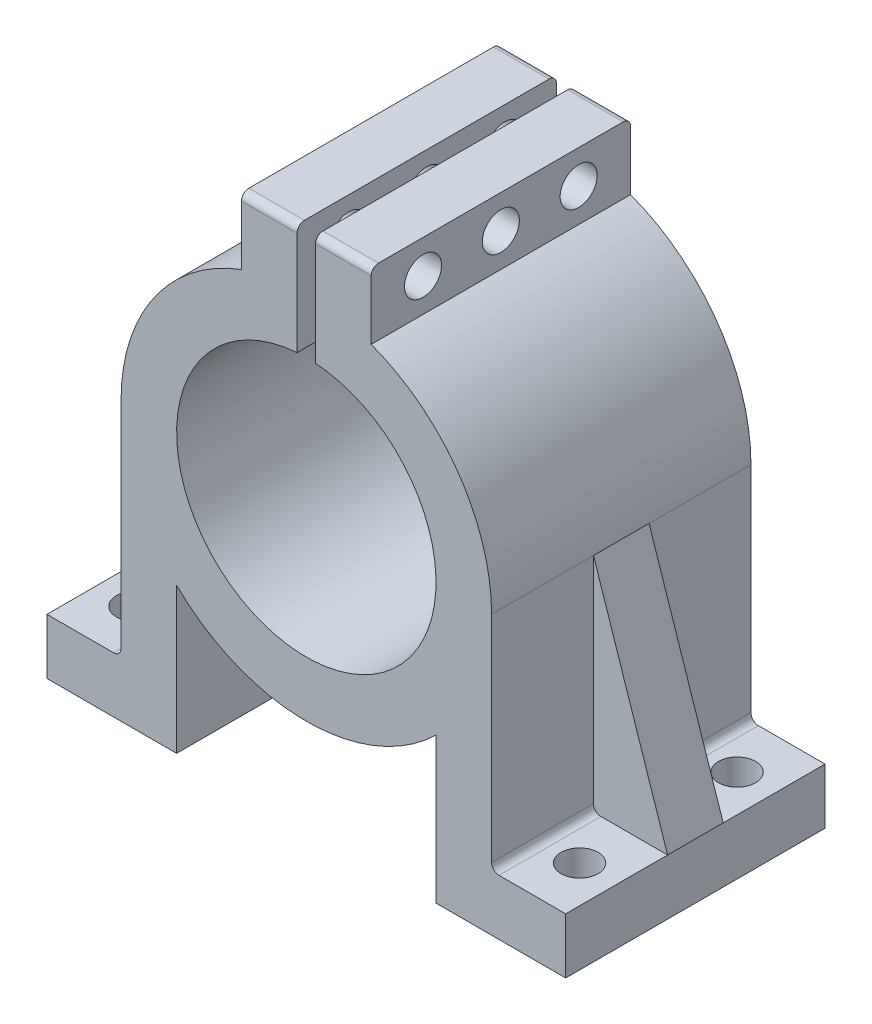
from build123d import *

# Parameters (mm, degrees)
SALIENTE_EXTRUIR1_DEPTH    = 14
CORTAR_EXTRUIR1_DEPTH      = 25.839484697
CORTAR_EXTRUIR1_DEPTH_BACK = 25.839484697
CROQUIS2_W                 = 0.4
CROQUIS2_H                 = 0.4
SALIENTE_EXTRUIR2_DEPTH    = 14
CORTAR_EXTRUIR2_DEPTH      = 25.839484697
CORTAR_EXTRUIR2_DEPTH_BACK = 5.5
CORTAR_EXTRUIR3_DEPTH      = 5.5
SALIENTE_EXTRUIR3_DEPTH    = 14
CROQUIS7_R                 = 1
CORTAR_EXTRUIR4_DEPTH      = 32.864963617
REDONDEO3_R                = 0.4
CROQUIS9_R                 = 1
CORTAR_EXTRUIR5_DEPTH      = 27.96757312


with BuildPart() as part:
    # Croquis1 → Saliente-Extruir1 (new body)
    with BuildSketch(Plane.XY):
        with BuildLine():
            Line((0.5, 6.982120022), (0.5, 12.967496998))
            Line((0.5, 12.967496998), (3.5, 12.967496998))
            Line((3.5, 12.967496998), (3.5, 9.367496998))
            ThreePointArc((3.5, 9.367496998), (8.215838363, 5.700877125), (10, 0))
            Line((10, 0), (10, -11.6))
            ThreePointArc((10, -11.6), (10.117157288, -11.882842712), (10.4, -12))
            Line((10.4, -12), (14, -12))
            Line((14, -12), (14, -15))
            Line((14, -15), (7, -15))
            Line((7, -15), (7, -7.141428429))
            ThreePointArc((7, -7.141428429), (0, -10), (-7, -7.141428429))
            Line((-7, -7.141428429), (-7, -15))
            Line((-7, -15), (-14, -15))
            Line((-14, -15), (-14, -12))
            Line((-14, -12), (-10.4, -12))
            ThreePointArc((-10.4, -12), (-10.117157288, -11.882842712), (-10, -11.6))
            Line((-10, -11.6), (-10, 0))
            ThreePointArc((-10, 0), (-8.215838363, 5.700877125), (-3.5, 9.367496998))
            Line((-3.5, 9.367496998), (-3.5, 12.967496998))
            Line((-3.5, 12.967496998), (-0.5, 12.967496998))
            Line((-0.5, 12.967496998), (-0.5, 6.982120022))
            ThreePointArc((-0.5, 6.982120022), (0, -7), (0.5, 6.982120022))
        make_face()
    extrude(amount=SALIENTE_EXTRUIR1_DEPTH)

    # Croquis2 → Cortar-Extruir1 (cut, two sides: drawn at the far end of the back side and taken through both)
    with BuildSketch(Plane.XY.offset(14).offset(-CORTAR_EXTRUIR1_DEPTH_BACK)):
        with Locations((-7.2, -14.8)):
            Rectangle(CROQUIS2_W, CROQUIS2_H)
        with Locations((7.2, -14.8)):
            Rectangle(CROQUIS2_W, CROQUIS2_H)
    extrude(amount=CORTAR_EXTRUIR1_DEPTH + CORTAR_EXTRUIR1_DEPTH_BACK, mode=Mode.SUBTRACT)

    # Croquis4 → Saliente-Extruir2 (add, through all)
    with BuildSketch(Plane.XY.offset(14)):
        Polygon((-14, -12), (-10, 0), (-10, -12), align=None)
        Polygon((14, -12), (10, 0), (10, -12), align=None)
    extrude(amount=-SALIENTE_EXTRUIR2_DEPTH)

    # Croquis5 → Cortar-Extruir2 (cut, two sides: drawn at the far end of the back side and taken through both)
    with BuildSketch(Plane.XY.offset(14).offset(-CORTAR_EXTRUIR2_DEPTH_BACK)):
        Polygon((-14, -12), (-10, 0), (-10, -12), align=None)
        Polygon((14, -12), (10, 0), (10, -12), align=None)
    extrude(amount=CORTAR_EXTRUIR2_DEPTH + CORTAR_EXTRUIR2_DEPTH_BACK, mode=Mode.SUBTRACT)

    # Croquis6 → Cortar-Extruir3 (cut)
    with BuildSketch(Plane(origin=(0, 0, 0), x_dir=(-1, 0, 0), z_dir=(0, 0, -1))):
        Polygon((-14, -12), (-10, 0), (-10, -12), align=None)
        Polygon((14, -12), (10, 0), (10, -12), align=None)
    extrude(amount=-CORTAR_EXTRUIR3_DEPTH, mode=Mode.SUBTRACT)

    # Croquis1_2 → Saliente-Extruir3 (add, through all)
    with BuildSketch(Plane.XY):
        with BuildLine():
            Line((0.5, 6.982120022), (0.5, 12.967496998))
            Line((0.5, 12.967496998), (3.5, 12.967496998))
            Line((3.5, 12.967496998), (3.5, 9.367496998))
            ThreePointArc((3.5, 9.367496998), (8.215838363, 5.700877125), (10, 0))
            Line((10, 0), (10, -11.6))
            ThreePointArc((10, -11.6), (10.117157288, -11.882842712), (10.4, -12))
            Line((10.4, -12), (14, -12))
            Line((14, -12), (14, -15))
            Line((14, -15), (7, -15))
            Line((7, -15), (7, -7.141428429))
            ThreePointArc((7, -7.141428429), (0, -10), (-7, -7.141428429))
            Line((-7, -7.141428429), (-7, -15))
            Line((-7, -15), (-14, -15))
            Line((-14, -15), (-14, -12))
            Line((-14, -12), (-10.4, -12))
            ThreePointArc((-10.4, -12), (-10.117157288, -11.882842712), (-10, -11.6))
            Line((-10, -11.6), (-10, 0))
            ThreePointArc((-10, 0), (-8.215838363, 5.700877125), (-3.5, 9.367496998))
            Line((-3.5, 9.367496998), (-3.5, 12.967496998))
            Line((-3.5, 12.967496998), (-0.5, 12.967496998))
            Line((-0.5, 12.967496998), (-0.5, 6.982120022))
            ThreePointArc((-0.5, 6.982120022), (0, -7), (0.5, 6.982120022))
        make_face()
    extrude(amount=SALIENTE_EXTRUIR3_DEPTH)

    # Croquis7 → Cortar-Extruir4 (cut, through all)
    with BuildSketch(Plane(origin=(0, -12, 0), x_dir=(1, 0, 0), z_dir=(0, 1, 0))):
        with Locations(Location((-12, -11.25, 0), (0, 0, 270))):
            Circle(CROQUIS7_R)
        with Locations(Location((-12, -2.75, 0), (0, 0, 270))):
            Circle(CROQUIS7_R)
        with Locations(Location((12, -2.75, 0), (0, 0, 270))):
            Circle(CROQUIS7_R)
        with Locations(Location((12, -11.25, 0), (0, 0, 270))):
            Circle(CROQUIS7_R)
    extrude(amount=-CORTAR_EXTRUIR4_DEPTH, mode=Mode.SUBTRACT)

    # Redondeo3
    redondeo3_edges = [part.edges().sort_by_distance(p)[0] for p in [
        (-2, 12.967496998, 0),
        (2, 12.967496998, 14),
        (-2, 12.967496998, 14),
        (2, 12.967496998, 0),
    ]]
    fillet(redondeo3_edges, radius=REDONDEO3_R)

    # Croquis9 → Cortar-Extruir5 (cut, through all)
    with BuildSketch(Plane.ZY.offset(3.5)):
        with Locations(Location((2.8, 11.167496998, 0), (0, 0, 270))):
            Circle(CROQUIS9_R)
        with Locations(Location((7.000061, 11.167496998, 0), (0, 0, 270))):
            Circle(CROQUIS9_R)
        with Locations(Location((11.200061, 11.167496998, 0), (0, 0, 270))):
            Circle(CROQUIS9_R)
    extrude(amount=-CORTAR_EXTRUIR5_DEPTH, mode=Mode.SUBTRACT)


solid = part.part
